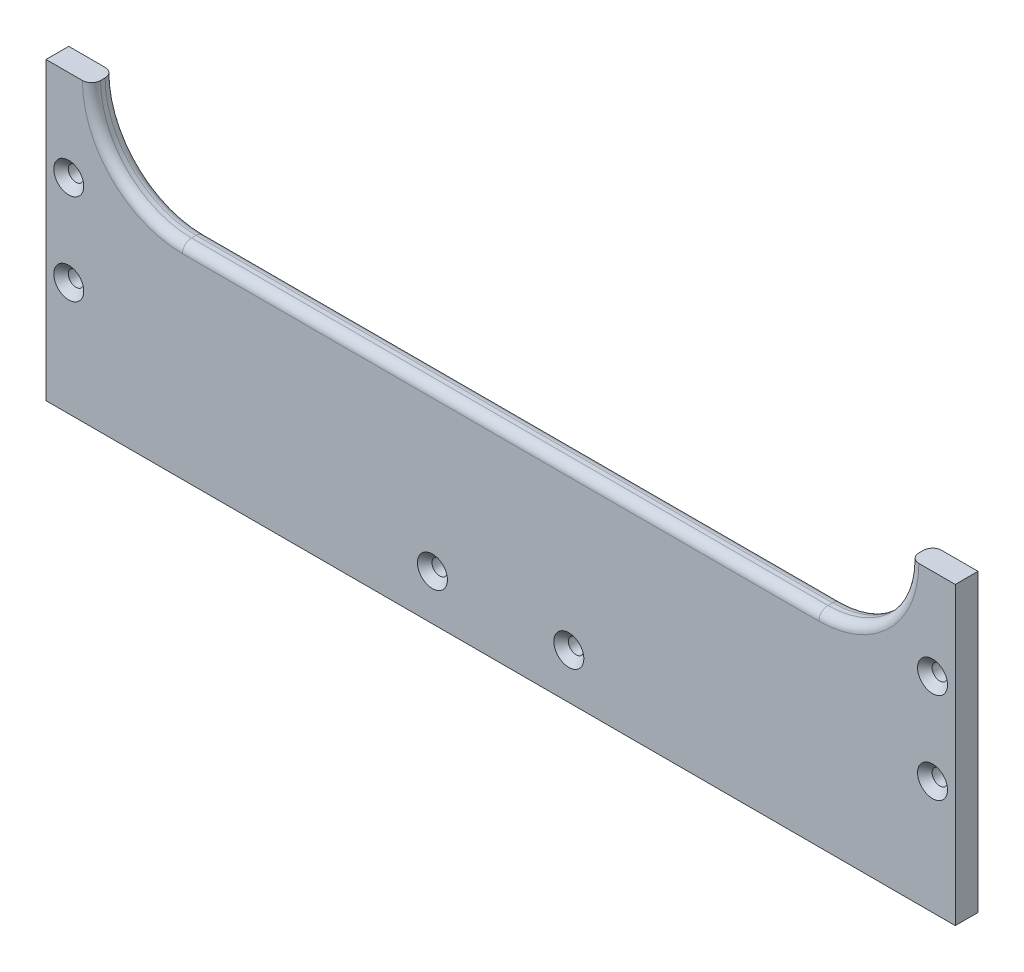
ISO-10303-21;
HEADER;
FILE_DESCRIPTION(('STEP AP214'),'2;1');
FILE_NAME('part.step','',(''),(''),'','','');
FILE_SCHEMA(('AUTOMOTIVE_DESIGN { 1 0 10303 214 1 1 1 1 }'));
ENDSEC;
DATA;
#1=APPLICATION_CONTEXT('core data for automotive mechanical design processes');
#2=APPLICATION_PROTOCOL_DEFINITION('international standard','automotive_design',2000,#1);
#3=PRODUCT_CONTEXT('',#1,'mechanical');
#4=PRODUCT('Part','Part','',(#3));
#5=PRODUCT_RELATED_PRODUCT_CATEGORY('part','',(#4));
#6=PRODUCT_DEFINITION_FORMATION('','',#4);
#7=PRODUCT_DEFINITION_CONTEXT('part definition',#1,'design');
#8=PRODUCT_DEFINITION('design','',#6,#7);
#9=PRODUCT_DEFINITION_SHAPE('','',#8);
#10=(LENGTH_UNIT() NAMED_UNIT(*) SI_UNIT(.MILLI.,.METRE.));
#11=(NAMED_UNIT(*) PLANE_ANGLE_UNIT() SI_UNIT($,.RADIAN.));
#12=(NAMED_UNIT(*) SI_UNIT($,.STERADIAN.) SOLID_ANGLE_UNIT());
#13=UNCERTAINTY_MEASURE_WITH_UNIT(LENGTH_MEASURE(1.E-05),#10,'distance_accuracy_value','');
#14=(GEOMETRIC_REPRESENTATION_CONTEXT(3) GLOBAL_UNCERTAINTY_ASSIGNED_CONTEXT((#13)) GLOBAL_UNIT_ASSIGNED_CONTEXT((#10,
#11,#12)) REPRESENTATION_CONTEXT('',''));
#15=CARTESIAN_POINT('',(0.,0.,0.));
#16=DIRECTION('',(0.,0.,1.));
#17=DIRECTION('',(1.,0.,0.));
#18=AXIS2_PLACEMENT_3D('',#15,#16,#17);
#19=CARTESIAN_POINT('',(0.,25.,0.));
#20=DIRECTION('',(0.,1.,0.));
#21=DIRECTION('',(0.,0.,1.));
#22=AXIS2_PLACEMENT_3D('',#19,#20,#21);
#23=PLANE('',#22);
#24=DIRECTION('',(0.,0.,1.));
#25=VECTOR('',#24,1.);
#26=CARTESIAN_POINT('',(-90.,25.,-5.));
#27=LINE('',#26,#25);
#28=CARTESIAN_POINT('',(-90.,25.,2.));
#29=VERTEX_POINT('',#28);
#30=CARTESIAN_POINT('',(-90.,25.,3.));
#31=VERTEX_POINT('',#30);
#32=EDGE_CURVE('E203',#29,#31,#27,.T.);
#33=ORIENTED_EDGE('',*,*,#32,.F.);
#34=CARTESIAN_POINT('',(-92.,25.,2.));
#35=DIRECTION('',(0.,1.,0.));
#36=DIRECTION('',(0.,0.,1.));
#37=AXIS2_PLACEMENT_3D('',#34,#35,#36);
#38=CIRCLE('',#37,2.);
#39=CARTESIAN_POINT('',(-92.,25.,0.));
#40=VERTEX_POINT('',#39);
#41=EDGE_CURVE('E136',#29,#40,#38,.T.);
#42=ORIENTED_EDGE('',*,*,#41,.T.);
#43=DIRECTION('',(-1.,0.,0.));
#44=VECTOR('',#43,1.);
#45=CARTESIAN_POINT('',(100.,25.,0.));
#46=LINE('',#45,#44);
#47=CARTESIAN_POINT('',(-100.,25.,0.));
#48=VERTEX_POINT('',#47);
#49=EDGE_CURVE('E129',#40,#48,#46,.T.);
#50=ORIENTED_EDGE('',*,*,#49,.T.);
#51=DIRECTION('',(0.,0.,1.));
#52=VECTOR('',#51,1.);
#53=CARTESIAN_POINT('',(-100.,25.,0.));
#54=LINE('',#53,#52);
#55=CARTESIAN_POINT('',(-100.,25.,5.));
#56=VERTEX_POINT('',#55);
#57=EDGE_CURVE('E133',#48,#56,#54,.T.);
#58=ORIENTED_EDGE('',*,*,#57,.T.);
#59=DIRECTION('',(1.,0.,0.));
#60=VECTOR('',#59,1.);
#61=CARTESIAN_POINT('',(-100.,25.,5.));
#62=LINE('',#61,#60);
#63=CARTESIAN_POINT('',(-92.,25.,5.));
#64=VERTEX_POINT('',#63);
#65=EDGE_CURVE('E259',#56,#64,#62,.T.);
#66=ORIENTED_EDGE('',*,*,#65,.T.);
#67=CARTESIAN_POINT('',(-92.,25.,3.));
#68=DIRECTION('',(0.,1.,0.));
#69=DIRECTION('',(0.,0.,1.));
#70=AXIS2_PLACEMENT_3D('',#67,#68,#69);
#71=CIRCLE('',#70,2.);
#72=EDGE_CURVE('E214',#64,#31,#71,.T.);
#73=ORIENTED_EDGE('',*,*,#72,.T.);
#74=EDGE_LOOP('',(#33,#42,#50,#58,#66,#73));
#75=FACE_BOUND('',#74,.T.);
#76=ADVANCED_FACE('F39',(#75),#23,.T.);
#77=CARTESIAN_POINT('',(100.,40.,5.));
#78=DIRECTION('',(-1.,0.,0.));
#79=DIRECTION('',(0.,-1.,0.));
#80=AXIS2_PLACEMENT_3D('',#77,#78,#79);
#81=PLANE('',#80);
#82=DIRECTION('',(0.,0.,-1.));
#83=VECTOR('',#82,1.);
#84=CARTESIAN_POINT('',(100.,25.,5.));
#85=LINE('',#84,#83);
#86=CARTESIAN_POINT('',(100.,25.,5.));
#87=VERTEX_POINT('',#86);
#88=CARTESIAN_POINT('',(100.,25.,0.));
#89=VERTEX_POINT('',#88);
#90=EDGE_CURVE('E142',#87,#89,#85,.T.);
#91=ORIENTED_EDGE('',*,*,#90,.F.);
#92=DIRECTION('',(0.,1.,0.));
#93=VECTOR('',#92,1.);
#94=CARTESIAN_POINT('',(100.,40.,5.));
#95=LINE('',#94,#93);
#96=CARTESIAN_POINT('',(100.,-40.,5.));
#97=VERTEX_POINT('',#96);
#98=EDGE_CURVE('E160',#97,#87,#95,.T.);
#99=ORIENTED_EDGE('',*,*,#98,.F.);
#100=DIRECTION('',(0.,0.,-1.));
#101=VECTOR('',#100,1.);
#102=CARTESIAN_POINT('',(100.,-40.,5.));
#103=LINE('',#102,#101);
#104=CARTESIAN_POINT('',(100.,-40.,0.));
#105=VERTEX_POINT('',#104);
#106=EDGE_CURVE('E167',#97,#105,#103,.T.);
#107=ORIENTED_EDGE('',*,*,#106,.T.);
#108=DIRECTION('',(0.,1.,0.));
#109=VECTOR('',#108,1.);
#110=CARTESIAN_POINT('',(100.,40.,0.));
#111=LINE('',#110,#109);
#112=EDGE_CURVE('E158',#105,#89,#111,.T.);
#113=ORIENTED_EDGE('',*,*,#112,.T.);
#114=EDGE_LOOP('',(#91,#99,#107,#113));
#115=FACE_BOUND('',#114,.T.);
#116=ADVANCED_FACE('F298',(#115),#81,.F.);
#117=CARTESIAN_POINT('',(-100.,40.,5.));
#118=DIRECTION('',(1.,0.,0.));
#119=DIRECTION('',(0.,1.,0.));
#120=AXIS2_PLACEMENT_3D('',#117,#118,#119);
#121=PLANE('',#120);
#122=ORIENTED_EDGE('',*,*,#57,.F.);
#123=DIRECTION('',(0.,-1.,0.));
#124=VECTOR('',#123,1.);
#125=CARTESIAN_POINT('',(-100.,40.,0.));
#126=LINE('',#125,#124);
#127=CARTESIAN_POINT('',(-100.,-40.,0.));
#128=VERTEX_POINT('',#127);
#129=EDGE_CURVE('E148',#48,#128,#126,.T.);
#130=ORIENTED_EDGE('',*,*,#129,.T.);
#131=DIRECTION('',(0.,0.,-1.));
#132=VECTOR('',#131,1.);
#133=CARTESIAN_POINT('',(-100.,-40.,5.));
#134=LINE('',#133,#132);
#135=CARTESIAN_POINT('',(-100.,-40.,5.));
#136=VERTEX_POINT('',#135);
#137=EDGE_CURVE('E170',#136,#128,#134,.T.);
#138=ORIENTED_EDGE('',*,*,#137,.F.);
#139=DIRECTION('',(0.,-1.,0.));
#140=VECTOR('',#139,1.);
#141=CARTESIAN_POINT('',(-100.,40.,5.));
#142=LINE('',#141,#140);
#143=EDGE_CURVE('E150',#56,#136,#142,.T.);
#144=ORIENTED_EDGE('',*,*,#143,.F.);
#145=EDGE_LOOP('',(#122,#130,#138,#144));
#146=FACE_BOUND('',#145,.T.);
#147=ADVANCED_FACE('F146',(#146),#121,.F.);
#148=CARTESIAN_POINT('',(0.,0.,5.));
#149=DIRECTION('',(0.,0.,1.));
#150=DIRECTION('',(1.,0.,0.));
#151=AXIS2_PLACEMENT_3D('',#148,#149,#150);
#152=PLANE('',#151);
#153=DIRECTION('',(1.,0.,0.));
#154=VECTOR('',#153,1.);
#155=CARTESIAN_POINT('',(-70.,3.00000000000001,5.));
#156=LINE('',#155,#154);
#157=CARTESIAN_POINT('',(70.,3.,5.));
#158=VERTEX_POINT('',#157);
#159=CARTESIAN_POINT('',(-70.,3.00000000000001,5.));
#160=VERTEX_POINT('',#159);
#161=EDGE_CURVE('E208',#158,#160,#156,.F.);
#162=ORIENTED_EDGE('',*,*,#161,.T.);
#163=CARTESIAN_POINT('',(-70.,25.,5.));
#164=DIRECTION('',(0.,0.,1.));
#165=DIRECTION('',(1.,0.,0.));
#166=AXIS2_PLACEMENT_3D('',#163,#164,#165);
#167=CIRCLE('',#166,22.);
#168=EDGE_CURVE('E212',#160,#64,#167,.F.);
#169=ORIENTED_EDGE('',*,*,#168,.T.);
#170=ORIENTED_EDGE('',*,*,#65,.F.);
#171=ORIENTED_EDGE('',*,*,#143,.T.);
#172=DIRECTION('',(1.,0.,0.));
#173=VECTOR('',#172,1.);
#174=CARTESIAN_POINT('',(-100.,-40.,5.));
#175=LINE('',#174,#173);
#176=EDGE_CURVE('E171',#136,#97,#175,.T.);
#177=ORIENTED_EDGE('',*,*,#176,.T.);
#178=ORIENTED_EDGE('',*,*,#98,.T.);
#179=CARTESIAN_POINT('',(92.,25.,5.));
#180=VERTEX_POINT('',#179);
#181=EDGE_CURVE('E151',#180,#87,#62,.T.);
#182=ORIENTED_EDGE('',*,*,#181,.F.);
#183=CARTESIAN_POINT('',(70.,25.,5.));
#184=DIRECTION('',(0.,0.,1.));
#185=DIRECTION('',(1.,0.,0.));
#186=AXIS2_PLACEMENT_3D('',#183,#184,#185);
#187=CIRCLE('',#186,22.);
#188=EDGE_CURVE('E210',#180,#158,#187,.F.);
#189=ORIENTED_EDGE('',*,*,#188,.T.);
#190=EDGE_LOOP('',(#162,#169,#170,#171,#177,#178,#182,#189));
#191=FACE_BOUND('',#190,.T.);
#192=CARTESIAN_POINT('',(-15.,-30.,5.));
#193=DIRECTION('',(0.,0.,1.));
#194=DIRECTION('',(1.,0.,0.));
#195=AXIS2_PLACEMENT_3D('',#192,#193,#194);
#196=CIRCLE('',#195,3.3);
#197=CARTESIAN_POINT('',(-11.7,-30.,5.));
#198=VERTEX_POINT('',#197);
#199=EDGE_CURVE('E261',#198,#198,#196,.T.);
#200=ORIENTED_EDGE('',*,*,#199,.F.);
#201=EDGE_LOOP('',(#200));
#202=FACE_BOUND('',#201,.T.);
#203=CARTESIAN_POINT('',(15.,-30.,5.));
#204=DIRECTION('',(0.,0.,1.));
#205=DIRECTION('',(1.,0.,0.));
#206=AXIS2_PLACEMENT_3D('',#203,#204,#205);
#207=CIRCLE('',#206,3.3);
#208=CARTESIAN_POINT('',(18.3,-30.,5.));
#209=VERTEX_POINT('',#208);
#210=EDGE_CURVE('E200',#209,#209,#207,.T.);
#211=ORIENTED_EDGE('',*,*,#210,.F.);
#212=EDGE_LOOP('',(#211));
#213=FACE_BOUND('',#212,.T.);
#214=CARTESIAN_POINT('',(-95.,-15.,5.));
#215=DIRECTION('',(0.,0.,1.));
#216=DIRECTION('',(1.,0.,0.));
#217=AXIS2_PLACEMENT_3D('',#214,#215,#216);
#218=CIRCLE('',#217,3.3);
#219=CARTESIAN_POINT('',(-91.7,-15.,5.));
#220=VERTEX_POINT('',#219);
#221=EDGE_CURVE('E195',#220,#220,#218,.T.);
#222=ORIENTED_EDGE('',*,*,#221,.F.);
#223=EDGE_LOOP('',(#222));
#224=FACE_BOUND('',#223,.T.);
#225=CARTESIAN_POINT('',(-95.,5.,5.));
#226=DIRECTION('',(0.,0.,1.));
#227=DIRECTION('',(1.,0.,0.));
#228=AXIS2_PLACEMENT_3D('',#225,#226,#227);
#229=CIRCLE('',#228,3.3);
#230=CARTESIAN_POINT('',(-91.7,5.,5.));
#231=VERTEX_POINT('',#230);
#232=EDGE_CURVE('E190',#231,#231,#229,.T.);
#233=ORIENTED_EDGE('',*,*,#232,.F.);
#234=EDGE_LOOP('',(#233));
#235=FACE_BOUND('',#234,.T.);
#236=CARTESIAN_POINT('',(95.,5.,5.));
#237=DIRECTION('',(0.,0.,1.));
#238=DIRECTION('',(1.,0.,0.));
#239=AXIS2_PLACEMENT_3D('',#236,#237,#238);
#240=CIRCLE('',#239,3.3);
#241=CARTESIAN_POINT('',(98.3,5.,5.));
#242=VERTEX_POINT('',#241);
#243=EDGE_CURVE('E185',#242,#242,#240,.T.);
#244=ORIENTED_EDGE('',*,*,#243,.F.);
#245=EDGE_LOOP('',(#244));
#246=FACE_BOUND('',#245,.T.);
#247=CARTESIAN_POINT('',(95.,-15.,5.));
#248=DIRECTION('',(0.,0.,1.));
#249=DIRECTION('',(1.,0.,0.));
#250=AXIS2_PLACEMENT_3D('',#247,#248,#249);
#251=CIRCLE('',#250,3.3);
#252=CARTESIAN_POINT('',(98.3,-15.,5.));
#253=VERTEX_POINT('',#252);
#254=EDGE_CURVE('E180',#253,#253,#251,.T.);
#255=ORIENTED_EDGE('',*,*,#254,.F.);
#256=EDGE_LOOP('',(#255));
#257=FACE_BOUND('',#256,.T.);
#258=ADVANCED_FACE('F291',(#191,#202,#213,#224,#235,#246,#257),#152,.T.);
#259=CARTESIAN_POINT('',(0.,0.,0.));
#260=DIRECTION('',(0.,0.,1.));
#261=DIRECTION('',(1.,0.,0.));
#262=AXIS2_PLACEMENT_3D('',#259,#260,#261);
#263=PLANE('',#262);
#264=ORIENTED_EDGE('',*,*,#49,.F.);
#265=CARTESIAN_POINT('',(-70.,25.,0.));
#266=DIRECTION('',(0.,0.,1.));
#267=DIRECTION('',(1.,0.,0.));
#268=AXIS2_PLACEMENT_3D('',#265,#266,#267);
#269=CIRCLE('',#268,22.);
#270=CARTESIAN_POINT('',(-70.,3.00000000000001,0.));
#271=VERTEX_POINT('',#270);
#272=EDGE_CURVE('E235',#40,#271,#269,.T.);
#273=ORIENTED_EDGE('',*,*,#272,.T.);
#274=DIRECTION('',(1.,0.,0.));
#275=VECTOR('',#274,1.);
#276=CARTESIAN_POINT('',(0.,3.00000000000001,0.));
#277=LINE('',#276,#275);
#278=CARTESIAN_POINT('',(70.,3.,0.));
#279=VERTEX_POINT('',#278);
#280=EDGE_CURVE('E224',#271,#279,#277,.T.);
#281=ORIENTED_EDGE('',*,*,#280,.T.);
#282=CARTESIAN_POINT('',(70.,25.,0.));
#283=DIRECTION('',(0.,0.,1.));
#284=DIRECTION('',(1.,0.,0.));
#285=AXIS2_PLACEMENT_3D('',#282,#283,#284);
#286=CIRCLE('',#285,22.);
#287=CARTESIAN_POINT('',(92.,25.,0.));
#288=VERTEX_POINT('',#287);
#289=EDGE_CURVE('E233',#279,#288,#286,.T.);
#290=ORIENTED_EDGE('',*,*,#289,.T.);
#291=EDGE_CURVE('E141',#89,#288,#46,.T.);
#292=ORIENTED_EDGE('',*,*,#291,.F.);
#293=ORIENTED_EDGE('',*,*,#112,.F.);
#294=DIRECTION('',(1.,0.,0.));
#295=VECTOR('',#294,1.);
#296=CARTESIAN_POINT('',(-100.,-40.,0.));
#297=LINE('',#296,#295);
#298=EDGE_CURVE('E157',#128,#105,#297,.T.);
#299=ORIENTED_EDGE('',*,*,#298,.F.);
#300=ORIENTED_EDGE('',*,*,#129,.F.);
#301=EDGE_LOOP('',(#264,#273,#281,#290,#292,#293,#299,#300));
#302=FACE_BOUND('',#301,.T.);
#303=CARTESIAN_POINT('',(95.,-15.,0.));
#304=DIRECTION('',(0.,0.,1.));
#305=DIRECTION('',(1.,0.,0.));
#306=AXIS2_PLACEMENT_3D('',#303,#304,#305);
#307=CIRCLE('',#306,1.69999999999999);
#308=CARTESIAN_POINT('',(96.7,-15.,0.));
#309=VERTEX_POINT('',#308);
#310=EDGE_CURVE('E163',#309,#309,#307,.T.);
#311=ORIENTED_EDGE('',*,*,#310,.T.);
#312=EDGE_LOOP('',(#311));
#313=FACE_BOUND('',#312,.T.);
#314=CARTESIAN_POINT('',(95.,5.,0.));
#315=DIRECTION('',(0.,0.,1.));
#316=DIRECTION('',(1.,0.,0.));
#317=AXIS2_PLACEMENT_3D('',#314,#315,#316);
#318=CIRCLE('',#317,1.69999999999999);
#319=CARTESIAN_POINT('',(96.7,5.,0.));
#320=VERTEX_POINT('',#319);
#321=EDGE_CURVE('E177',#320,#320,#318,.T.);
#322=ORIENTED_EDGE('',*,*,#321,.T.);
#323=EDGE_LOOP('',(#322));
#324=FACE_BOUND('',#323,.T.);
#325=CARTESIAN_POINT('',(-95.,5.,0.));
#326=DIRECTION('',(0.,0.,1.));
#327=DIRECTION('',(1.,0.,0.));
#328=AXIS2_PLACEMENT_3D('',#325,#326,#327);
#329=CIRCLE('',#328,1.69999999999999);
#330=CARTESIAN_POINT('',(-93.3,5.,0.));
#331=VERTEX_POINT('',#330);
#332=EDGE_CURVE('E182',#331,#331,#329,.T.);
#333=ORIENTED_EDGE('',*,*,#332,.T.);
#334=EDGE_LOOP('',(#333));
#335=FACE_BOUND('',#334,.T.);
#336=CARTESIAN_POINT('',(-95.,-15.,0.));
#337=DIRECTION('',(0.,0.,1.));
#338=DIRECTION('',(1.,0.,0.));
#339=AXIS2_PLACEMENT_3D('',#336,#337,#338);
#340=CIRCLE('',#339,1.69999999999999);
#341=CARTESIAN_POINT('',(-93.3,-15.,0.));
#342=VERTEX_POINT('',#341);
#343=EDGE_CURVE('E187',#342,#342,#340,.T.);
#344=ORIENTED_EDGE('',*,*,#343,.T.);
#345=EDGE_LOOP('',(#344));
#346=FACE_BOUND('',#345,.T.);
#347=CARTESIAN_POINT('',(15.,-30.,0.));
#348=DIRECTION('',(0.,0.,1.));
#349=DIRECTION('',(1.,0.,0.));
#350=AXIS2_PLACEMENT_3D('',#347,#348,#349);
#351=CIRCLE('',#350,1.69999999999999);
#352=CARTESIAN_POINT('',(16.7,-30.,0.));
#353=VERTEX_POINT('',#352);
#354=EDGE_CURVE('E192',#353,#353,#351,.T.);
#355=ORIENTED_EDGE('',*,*,#354,.T.);
#356=EDGE_LOOP('',(#355));
#357=FACE_BOUND('',#356,.T.);
#358=CARTESIAN_POINT('',(-15.,-30.,0.));
#359=DIRECTION('',(0.,0.,1.));
#360=DIRECTION('',(1.,0.,0.));
#361=AXIS2_PLACEMENT_3D('',#358,#359,#360);
#362=CIRCLE('',#361,1.69999999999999);
#363=CARTESIAN_POINT('',(-13.3,-30.,0.));
#364=VERTEX_POINT('',#363);
#365=EDGE_CURVE('E197',#364,#364,#362,.T.);
#366=ORIENTED_EDGE('',*,*,#365,.T.);
#367=EDGE_LOOP('',(#366));
#368=FACE_BOUND('',#367,.T.);
#369=ADVANCED_FACE('F154',(#302,#313,#324,#335,#346,#357,#368),#263,.F.);
#370=CARTESIAN_POINT('',(-100.,-40.,5.));
#371=DIRECTION('',(0.,1.,0.));
#372=DIRECTION('',(0.,0.,1.));
#373=AXIS2_PLACEMENT_3D('',#370,#371,#372);
#374=PLANE('',#373);
#375=ORIENTED_EDGE('',*,*,#298,.T.);
#376=ORIENTED_EDGE('',*,*,#106,.F.);
#377=ORIENTED_EDGE('',*,*,#176,.F.);
#378=ORIENTED_EDGE('',*,*,#137,.T.);
#379=EDGE_LOOP('',(#375,#376,#377,#378));
#380=FACE_BOUND('',#379,.T.);
#381=ADVANCED_FACE('F296',(#380),#374,.F.);
#382=CARTESIAN_POINT('',(95.,-15.,5.));
#383=DIRECTION('',(0.,0.,1.));
#384=DIRECTION('',(1.,0.,0.));
#385=AXIS2_PLACEMENT_3D('',#382,#383,#384);
#386=CYLINDRICAL_SURFACE('',#385,1.69999999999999);
#387=CARTESIAN_POINT('',(95.,-15.,3.39999999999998));
#388=DIRECTION('',(0.,0.,1.));
#389=DIRECTION('',(1.,0.,0.));
#390=AXIS2_PLACEMENT_3D('',#387,#388,#389);
#391=CIRCLE('',#390,1.69999999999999);
#392=CARTESIAN_POINT('',(96.7,-15.,3.39999999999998));
#393=VERTEX_POINT('',#392);
#394=EDGE_CURVE('E176',#393,#393,#391,.T.);
#395=ORIENTED_EDGE('',*,*,#394,.T.);
#396=EDGE_LOOP('',(#395));
#397=FACE_BOUND('',#396,.T.);
#398=ORIENTED_EDGE('',*,*,#310,.F.);
#399=EDGE_LOOP('',(#398));
#400=FACE_BOUND('',#399,.T.);
#401=ADVANCED_FACE('F390',(#397,#400),#386,.F.);
#402=CARTESIAN_POINT('',(95.,-15.,5.));
#403=DIRECTION('',(0.,0.,1.));
#404=DIRECTION('',(1.,0.,0.));
#405=AXIS2_PLACEMENT_3D('',#402,#403,#404);
#406=CONICAL_SURFACE('',#405,3.3,0.785398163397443);
#407=ORIENTED_EDGE('',*,*,#394,.F.);
#408=EDGE_LOOP('',(#407));
#409=FACE_BOUND('',#408,.T.);
#410=ORIENTED_EDGE('',*,*,#254,.T.);
#411=EDGE_LOOP('',(#410));
#412=FACE_BOUND('',#411,.T.);
#413=ADVANCED_FACE('F386',(#409,#412),#406,.F.);
#414=CARTESIAN_POINT('',(95.,5.,5.));
#415=DIRECTION('',(0.,0.,1.));
#416=DIRECTION('',(1.,0.,0.));
#417=AXIS2_PLACEMENT_3D('',#414,#415,#416);
#418=CYLINDRICAL_SURFACE('',#417,1.69999999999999);
#419=CARTESIAN_POINT('',(95.,5.,3.39999999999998));
#420=DIRECTION('',(0.,0.,1.));
#421=DIRECTION('',(1.,0.,0.));
#422=AXIS2_PLACEMENT_3D('',#419,#420,#421);
#423=CIRCLE('',#422,1.69999999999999);
#424=CARTESIAN_POINT('',(96.7,5.,3.39999999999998));
#425=VERTEX_POINT('',#424);
#426=EDGE_CURVE('E181',#425,#425,#423,.T.);
#427=ORIENTED_EDGE('',*,*,#426,.T.);
#428=EDGE_LOOP('',(#427));
#429=FACE_BOUND('',#428,.T.);
#430=ORIENTED_EDGE('',*,*,#321,.F.);
#431=EDGE_LOOP('',(#430));
#432=FACE_BOUND('',#431,.T.);
#433=ADVANCED_FACE('F382',(#429,#432),#418,.F.);
#434=CARTESIAN_POINT('',(95.,5.,5.));
#435=DIRECTION('',(0.,0.,1.));
#436=DIRECTION('',(1.,0.,0.));
#437=AXIS2_PLACEMENT_3D('',#434,#435,#436);
#438=CONICAL_SURFACE('',#437,3.3,0.785398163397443);
#439=ORIENTED_EDGE('',*,*,#426,.F.);
#440=EDGE_LOOP('',(#439));
#441=FACE_BOUND('',#440,.T.);
#442=ORIENTED_EDGE('',*,*,#243,.T.);
#443=EDGE_LOOP('',(#442));
#444=FACE_BOUND('',#443,.T.);
#445=ADVANCED_FACE('F378',(#441,#444),#438,.F.);
#446=CARTESIAN_POINT('',(-95.,5.,5.));
#447=DIRECTION('',(0.,0.,1.));
#448=DIRECTION('',(1.,0.,0.));
#449=AXIS2_PLACEMENT_3D('',#446,#447,#448);
#450=CYLINDRICAL_SURFACE('',#449,1.69999999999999);
#451=CARTESIAN_POINT('',(-95.,5.,3.39999999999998));
#452=DIRECTION('',(0.,0.,1.));
#453=DIRECTION('',(1.,0.,0.));
#454=AXIS2_PLACEMENT_3D('',#451,#452,#453);
#455=CIRCLE('',#454,1.69999999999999);
#456=CARTESIAN_POINT('',(-93.3,5.,3.39999999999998));
#457=VERTEX_POINT('',#456);
#458=EDGE_CURVE('E186',#457,#457,#455,.T.);
#459=ORIENTED_EDGE('',*,*,#458,.T.);
#460=EDGE_LOOP('',(#459));
#461=FACE_BOUND('',#460,.T.);
#462=ORIENTED_EDGE('',*,*,#332,.F.);
#463=EDGE_LOOP('',(#462));
#464=FACE_BOUND('',#463,.T.);
#465=ADVANCED_FACE('F374',(#461,#464),#450,.F.);
#466=CARTESIAN_POINT('',(-95.,5.,5.));
#467=DIRECTION('',(0.,0.,1.));
#468=DIRECTION('',(1.,0.,0.));
#469=AXIS2_PLACEMENT_3D('',#466,#467,#468);
#470=CONICAL_SURFACE('',#469,3.3,0.785398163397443);
#471=ORIENTED_EDGE('',*,*,#458,.F.);
#472=EDGE_LOOP('',(#471));
#473=FACE_BOUND('',#472,.T.);
#474=ORIENTED_EDGE('',*,*,#232,.T.);
#475=EDGE_LOOP('',(#474));
#476=FACE_BOUND('',#475,.T.);
#477=ADVANCED_FACE('F370',(#473,#476),#470,.F.);
#478=CARTESIAN_POINT('',(-95.,-15.,5.));
#479=DIRECTION('',(0.,0.,1.));
#480=DIRECTION('',(1.,0.,0.));
#481=AXIS2_PLACEMENT_3D('',#478,#479,#480);
#482=CYLINDRICAL_SURFACE('',#481,1.69999999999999);
#483=CARTESIAN_POINT('',(-95.,-15.,3.39999999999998));
#484=DIRECTION('',(0.,0.,1.));
#485=DIRECTION('',(1.,0.,0.));
#486=AXIS2_PLACEMENT_3D('',#483,#484,#485);
#487=CIRCLE('',#486,1.69999999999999);
#488=CARTESIAN_POINT('',(-93.3,-15.,3.39999999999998));
#489=VERTEX_POINT('',#488);
#490=EDGE_CURVE('E191',#489,#489,#487,.T.);
#491=ORIENTED_EDGE('',*,*,#490,.T.);
#492=EDGE_LOOP('',(#491));
#493=FACE_BOUND('',#492,.T.);
#494=ORIENTED_EDGE('',*,*,#343,.F.);
#495=EDGE_LOOP('',(#494));
#496=FACE_BOUND('',#495,.T.);
#497=ADVANCED_FACE('F366',(#493,#496),#482,.F.);
#498=CARTESIAN_POINT('',(-95.,-15.,5.));
#499=DIRECTION('',(0.,0.,1.));
#500=DIRECTION('',(1.,0.,0.));
#501=AXIS2_PLACEMENT_3D('',#498,#499,#500);
#502=CONICAL_SURFACE('',#501,3.3,0.785398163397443);
#503=ORIENTED_EDGE('',*,*,#490,.F.);
#504=EDGE_LOOP('',(#503));
#505=FACE_BOUND('',#504,.T.);
#506=ORIENTED_EDGE('',*,*,#221,.T.);
#507=EDGE_LOOP('',(#506));
#508=FACE_BOUND('',#507,.T.);
#509=ADVANCED_FACE('F362',(#505,#508),#502,.F.);
#510=CARTESIAN_POINT('',(15.,-30.,5.));
#511=DIRECTION('',(0.,0.,1.));
#512=DIRECTION('',(1.,0.,0.));
#513=AXIS2_PLACEMENT_3D('',#510,#511,#512);
#514=CYLINDRICAL_SURFACE('',#513,1.69999999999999);
#515=CARTESIAN_POINT('',(15.,-30.,3.39999999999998));
#516=DIRECTION('',(0.,0.,1.));
#517=DIRECTION('',(1.,0.,0.));
#518=AXIS2_PLACEMENT_3D('',#515,#516,#517);
#519=CIRCLE('',#518,1.69999999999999);
#520=CARTESIAN_POINT('',(16.7,-30.,3.39999999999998));
#521=VERTEX_POINT('',#520);
#522=EDGE_CURVE('E196',#521,#521,#519,.T.);
#523=ORIENTED_EDGE('',*,*,#522,.T.);
#524=EDGE_LOOP('',(#523));
#525=FACE_BOUND('',#524,.T.);
#526=ORIENTED_EDGE('',*,*,#354,.F.);
#527=EDGE_LOOP('',(#526));
#528=FACE_BOUND('',#527,.T.);
#529=ADVANCED_FACE('F358',(#525,#528),#514,.F.);
#530=CARTESIAN_POINT('',(15.,-30.,5.));
#531=DIRECTION('',(0.,0.,1.));
#532=DIRECTION('',(1.,0.,0.));
#533=AXIS2_PLACEMENT_3D('',#530,#531,#532);
#534=CONICAL_SURFACE('',#533,3.3,0.785398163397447);
#535=ORIENTED_EDGE('',*,*,#522,.F.);
#536=EDGE_LOOP('',(#535));
#537=FACE_BOUND('',#536,.T.);
#538=ORIENTED_EDGE('',*,*,#210,.T.);
#539=EDGE_LOOP('',(#538));
#540=FACE_BOUND('',#539,.T.);
#541=ADVANCED_FACE('F350',(#537,#540),#534,.F.);
#542=CARTESIAN_POINT('',(-15.,-30.,5.));
#543=DIRECTION('',(0.,0.,1.));
#544=DIRECTION('',(1.,0.,0.));
#545=AXIS2_PLACEMENT_3D('',#542,#543,#544);
#546=CYLINDRICAL_SURFACE('',#545,1.69999999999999);
#547=CARTESIAN_POINT('',(-15.,-30.,3.39999999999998));
#548=DIRECTION('',(0.,0.,1.));
#549=DIRECTION('',(1.,0.,0.));
#550=AXIS2_PLACEMENT_3D('',#547,#548,#549);
#551=CIRCLE('',#550,1.69999999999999);
#552=CARTESIAN_POINT('',(-13.3,-30.,3.39999999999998));
#553=VERTEX_POINT('',#552);
#554=EDGE_CURVE('E201',#553,#553,#551,.T.);
#555=ORIENTED_EDGE('',*,*,#554,.T.);
#556=EDGE_LOOP('',(#555));
#557=FACE_BOUND('',#556,.T.);
#558=ORIENTED_EDGE('',*,*,#365,.F.);
#559=EDGE_LOOP('',(#558));
#560=FACE_BOUND('',#559,.T.);
#561=ADVANCED_FACE('F345',(#557,#560),#546,.F.);
#562=CARTESIAN_POINT('',(-15.,-30.,5.));
#563=DIRECTION('',(0.,0.,1.));
#564=DIRECTION('',(1.,0.,0.));
#565=AXIS2_PLACEMENT_3D('',#562,#563,#564);
#566=CONICAL_SURFACE('',#565,3.3,0.785398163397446);
#567=ORIENTED_EDGE('',*,*,#554,.F.);
#568=EDGE_LOOP('',(#567));
#569=FACE_BOUND('',#568,.T.);
#570=ORIENTED_EDGE('',*,*,#199,.T.);
#571=EDGE_LOOP('',(#570));
#572=FACE_BOUND('',#571,.T.);
#573=ADVANCED_FACE('F340',(#569,#572),#566,.F.);
#574=ORIENTED_EDGE('',*,*,#291,.T.);
#575=CARTESIAN_POINT('',(92.,25.,2.));
#576=DIRECTION('',(0.,1.,0.));
#577=DIRECTION('',(0.,0.,1.));
#578=AXIS2_PLACEMENT_3D('',#575,#576,#577);
#579=CIRCLE('',#578,2.);
#580=CARTESIAN_POINT('',(90.,25.,2.));
#581=VERTEX_POINT('',#580);
#582=EDGE_CURVE('E63',#288,#581,#579,.T.);
#583=ORIENTED_EDGE('',*,*,#582,.T.);
#584=DIRECTION('',(0.,0.,1.));
#585=VECTOR('',#584,1.);
#586=CARTESIAN_POINT('',(90.,25.,-5.));
#587=LINE('',#586,#585);
#588=CARTESIAN_POINT('',(90.,25.,3.));
#589=VERTEX_POINT('',#588);
#590=EDGE_CURVE('E173',#589,#581,#587,.F.);
#591=ORIENTED_EDGE('',*,*,#590,.F.);
#592=CARTESIAN_POINT('',(92.,25.,3.));
#593=DIRECTION('',(0.,1.,0.));
#594=DIRECTION('',(0.,0.,1.));
#595=AXIS2_PLACEMENT_3D('',#592,#593,#594);
#596=CIRCLE('',#595,2.);
#597=EDGE_CURVE('E219',#589,#180,#596,.T.);
#598=ORIENTED_EDGE('',*,*,#597,.T.);
#599=ORIENTED_EDGE('',*,*,#181,.T.);
#600=ORIENTED_EDGE('',*,*,#90,.T.);
#601=EDGE_LOOP('',(#574,#583,#591,#598,#599,#600));
#602=FACE_BOUND('',#601,.T.);
#603=ADVANCED_FACE('F254',(#602),#23,.T.);
#604=CARTESIAN_POINT('',(-70.,5.00000000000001,-5.));
#605=DIRECTION('',(0.,-1.,0.));
#606=DIRECTION('',(1.,0.,0.));
#607=AXIS2_PLACEMENT_3D('',#604,#605,#606);
#608=PLANE('',#607);
#609=DIRECTION('',(0.,0.,1.));
#610=VECTOR('',#609,1.);
#611=CARTESIAN_POINT('',(70.,5.,-5.));
#612=LINE('',#611,#610);
#613=CARTESIAN_POINT('',(70.,5.,2.));
#614=VERTEX_POINT('',#613);
#615=CARTESIAN_POINT('',(70.,5.,3.));
#616=VERTEX_POINT('',#615);
#617=EDGE_CURVE('E299',#614,#616,#612,.T.);
#618=ORIENTED_EDGE('',*,*,#617,.F.);
#619=DIRECTION('',(1.,0.,0.));
#620=VECTOR('',#619,1.);
#621=CARTESIAN_POINT('',(-70.,5.00000000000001,2.));
#622=LINE('',#621,#620);
#623=CARTESIAN_POINT('',(-70.,5.00000000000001,2.));
#624=VERTEX_POINT('',#623);
#625=EDGE_CURVE('E11',#614,#624,#622,.F.);
#626=ORIENTED_EDGE('',*,*,#625,.T.);
#627=DIRECTION('',(0.,0.,1.));
#628=VECTOR('',#627,1.);
#629=CARTESIAN_POINT('',(-70.,5.00000000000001,-5.));
#630=LINE('',#629,#628);
#631=CARTESIAN_POINT('',(-70.,5.00000000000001,3.));
#632=VERTEX_POINT('',#631);
#633=EDGE_CURVE('E231',#624,#632,#630,.T.);
#634=ORIENTED_EDGE('',*,*,#633,.T.);
#635=DIRECTION('',(1.,0.,0.));
#636=VECTOR('',#635,1.);
#637=CARTESIAN_POINT('',(70.,5.,3.));
#638=LINE('',#637,#636);
#639=EDGE_CURVE('E221',#632,#616,#638,.T.);
#640=ORIENTED_EDGE('',*,*,#639,.T.);
#641=EDGE_LOOP('',(#618,#626,#634,#640));
#642=FACE_BOUND('',#641,.T.);
#643=ADVANCED_FACE('F303',(#642),#608,.F.);
#644=CARTESIAN_POINT('',(-70.,25.,-5.));
#645=DIRECTION('',(0.,0.,1.));
#646=DIRECTION('',(1.,0.,0.));
#647=AXIS2_PLACEMENT_3D('',#644,#645,#646);
#648=CYLINDRICAL_SURFACE('',#647,20.);
#649=ORIENTED_EDGE('',*,*,#633,.F.);
#650=CARTESIAN_POINT('',(-70.,25.,2.));
#651=DIRECTION('',(0.,0.,1.));
#652=DIRECTION('',(1.,0.,0.));
#653=AXIS2_PLACEMENT_3D('',#650,#651,#652);
#654=CIRCLE('',#653,20.);
#655=EDGE_CURVE('E237',#624,#29,#654,.F.);
#656=ORIENTED_EDGE('',*,*,#655,.T.);
#657=ORIENTED_EDGE('',*,*,#32,.T.);
#658=CARTESIAN_POINT('',(-70.,25.,3.));
#659=DIRECTION('',(0.,0.,1.));
#660=DIRECTION('',(1.,0.,0.));
#661=AXIS2_PLACEMENT_3D('',#658,#659,#660);
#662=CIRCLE('',#661,20.);
#663=EDGE_CURVE('E205',#31,#632,#662,.T.);
#664=ORIENTED_EDGE('',*,*,#663,.T.);
#665=EDGE_LOOP('',(#649,#656,#657,#664));
#666=FACE_BOUND('',#665,.T.);
#667=ADVANCED_FACE('F317',(#666),#648,.F.);
#668=CARTESIAN_POINT('',(70.,25.,-5.));
#669=DIRECTION('',(0.,0.,1.));
#670=DIRECTION('',(1.,0.,0.));
#671=AXIS2_PLACEMENT_3D('',#668,#669,#670);
#672=CYLINDRICAL_SURFACE('',#671,20.);
#673=ORIENTED_EDGE('',*,*,#590,.T.);
#674=CARTESIAN_POINT('',(70.,25.,2.));
#675=DIRECTION('',(0.,0.,1.));
#676=DIRECTION('',(1.,0.,0.));
#677=AXIS2_PLACEMENT_3D('',#674,#675,#676);
#678=CIRCLE('',#677,20.);
#679=EDGE_CURVE('E48',#581,#614,#678,.F.);
#680=ORIENTED_EDGE('',*,*,#679,.T.);
#681=ORIENTED_EDGE('',*,*,#617,.T.);
#682=CARTESIAN_POINT('',(70.,25.,3.));
#683=DIRECTION('',(0.,0.,1.));
#684=DIRECTION('',(1.,0.,0.));
#685=AXIS2_PLACEMENT_3D('',#682,#683,#684);
#686=CIRCLE('',#685,20.);
#687=EDGE_CURVE('E217',#616,#589,#686,.T.);
#688=ORIENTED_EDGE('',*,*,#687,.T.);
#689=EDGE_LOOP('',(#673,#680,#681,#688));
#690=FACE_BOUND('',#689,.T.);
#691=ADVANCED_FACE('F322',(#690),#672,.F.);
#692=CARTESIAN_POINT('',(70.,25.,3.));
#693=DIRECTION('',(0.,0.,1.));
#694=DIRECTION('',(1.,0.,0.));
#695=AXIS2_PLACEMENT_3D('',#692,#693,#694);
#696=TOROIDAL_SURFACE('',#695,22.,2.);
#697=ORIENTED_EDGE('',*,*,#597,.F.);
#698=ORIENTED_EDGE('',*,*,#687,.F.);
#699=CARTESIAN_POINT('',(70.,3.,3.));
#700=DIRECTION('',(-1.,0.,0.));
#701=DIRECTION('',(0.,0.,1.));
#702=AXIS2_PLACEMENT_3D('',#699,#700,#701);
#703=CIRCLE('',#702,2.);
#704=EDGE_CURVE('E228',#158,#616,#703,.T.);
#705=ORIENTED_EDGE('',*,*,#704,.F.);
#706=ORIENTED_EDGE('',*,*,#188,.F.);
#707=EDGE_LOOP('',(#697,#698,#705,#706));
#708=FACE_BOUND('',#707,.T.);
#709=ADVANCED_FACE('F321',(#708),#696,.T.);
#710=CARTESIAN_POINT('',(-70.,3.00000000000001,3.));
#711=DIRECTION('',(-1.,0.,0.));
#712=DIRECTION('',(0.,-1.,0.));
#713=AXIS2_PLACEMENT_3D('',#710,#711,#712);
#714=CYLINDRICAL_SURFACE('',#713,2.);
#715=ORIENTED_EDGE('',*,*,#704,.T.);
#716=ORIENTED_EDGE('',*,*,#639,.F.);
#717=CARTESIAN_POINT('',(-70.,3.00000000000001,3.));
#718=DIRECTION('',(-1.,0.,0.));
#719=DIRECTION('',(0.,0.,1.));
#720=AXIS2_PLACEMENT_3D('',#717,#718,#719);
#721=CIRCLE('',#720,2.);
#722=EDGE_CURVE('E225',#160,#632,#721,.T.);
#723=ORIENTED_EDGE('',*,*,#722,.F.);
#724=ORIENTED_EDGE('',*,*,#161,.F.);
#725=EDGE_LOOP('',(#715,#716,#723,#724));
#726=FACE_BOUND('',#725,.T.);
#727=ADVANCED_FACE('F315',(#726),#714,.T.);
#728=CARTESIAN_POINT('',(-70.,25.,3.));
#729=DIRECTION('',(0.,0.,1.));
#730=DIRECTION('',(1.,0.,0.));
#731=AXIS2_PLACEMENT_3D('',#728,#729,#730);
#732=TOROIDAL_SURFACE('',#731,22.,2.);
#733=ORIENTED_EDGE('',*,*,#72,.F.);
#734=ORIENTED_EDGE('',*,*,#168,.F.);
#735=ORIENTED_EDGE('',*,*,#722,.T.);
#736=ORIENTED_EDGE('',*,*,#663,.F.);
#737=EDGE_LOOP('',(#733,#734,#735,#736));
#738=FACE_BOUND('',#737,.T.);
#739=ADVANCED_FACE('F312',(#738),#732,.T.);
#740=CARTESIAN_POINT('',(70.,25.,2.));
#741=DIRECTION('',(0.,0.,1.));
#742=DIRECTION('',(1.,0.,0.));
#743=AXIS2_PLACEMENT_3D('',#740,#741,#742);
#744=TOROIDAL_SURFACE('',#743,22.,2.);
#745=ORIENTED_EDGE('',*,*,#582,.F.);
#746=ORIENTED_EDGE('',*,*,#289,.F.);
#747=CARTESIAN_POINT('',(70.,3.,2.));
#748=DIRECTION('',(-1.,0.,0.));
#749=DIRECTION('',(0.,0.,1.));
#750=AXIS2_PLACEMENT_3D('',#747,#748,#749);
#751=CIRCLE('',#750,2.);
#752=EDGE_CURVE('E43',#614,#279,#751,.T.);
#753=ORIENTED_EDGE('',*,*,#752,.F.);
#754=ORIENTED_EDGE('',*,*,#679,.F.);
#755=EDGE_LOOP('',(#745,#746,#753,#754));
#756=FACE_BOUND('',#755,.T.);
#757=ADVANCED_FACE('F41',(#756),#744,.T.);
#758=CARTESIAN_POINT('',(0.,3.00000000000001,2.));
#759=DIRECTION('',(1.,0.,0.));
#760=DIRECTION('',(0.,1.,0.));
#761=AXIS2_PLACEMENT_3D('',#758,#759,#760);
#762=CYLINDRICAL_SURFACE('',#761,2.);
#763=ORIENTED_EDGE('',*,*,#752,.T.);
#764=ORIENTED_EDGE('',*,*,#280,.F.);
#765=CARTESIAN_POINT('',(-70.,3.00000000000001,2.));
#766=DIRECTION('',(-1.,0.,0.));
#767=DIRECTION('',(0.,0.,1.));
#768=AXIS2_PLACEMENT_3D('',#765,#766,#767);
#769=CIRCLE('',#768,2.);
#770=EDGE_CURVE('E241',#624,#271,#769,.T.);
#771=ORIENTED_EDGE('',*,*,#770,.F.);
#772=ORIENTED_EDGE('',*,*,#625,.F.);
#773=EDGE_LOOP('',(#763,#764,#771,#772));
#774=FACE_BOUND('',#773,.T.);
#775=ADVANCED_FACE('F250',(#774),#762,.T.);
#776=CARTESIAN_POINT('',(-70.,25.,2.));
#777=DIRECTION('',(0.,0.,1.));
#778=DIRECTION('',(1.,0.,0.));
#779=AXIS2_PLACEMENT_3D('',#776,#777,#778);
#780=TOROIDAL_SURFACE('',#779,22.,2.);
#781=ORIENTED_EDGE('',*,*,#41,.F.);
#782=ORIENTED_EDGE('',*,*,#655,.F.);
#783=ORIENTED_EDGE('',*,*,#770,.T.);
#784=ORIENTED_EDGE('',*,*,#272,.F.);
#785=EDGE_LOOP('',(#781,#782,#783,#784));
#786=FACE_BOUND('',#785,.T.);
#787=ADVANCED_FACE('F407',(#786),#780,.T.);
#788=CLOSED_SHELL('',(#76,#116,#147,#258,#369,#381,#401,#413,#433,#445,#465,#477,#497,#509,#529,
#541,#561,#573,#603,#643,#667,#691,#709,#727,#739,#757,#775,#787));
#789=MANIFOLD_SOLID_BREP('B2',#788);
#790=ADVANCED_BREP_SHAPE_REPRESENTATION('',(#18,#789),#14);
#791=SHAPE_DEFINITION_REPRESENTATION(#9,#790);
ENDSEC;
END-ISO-10303-21;
